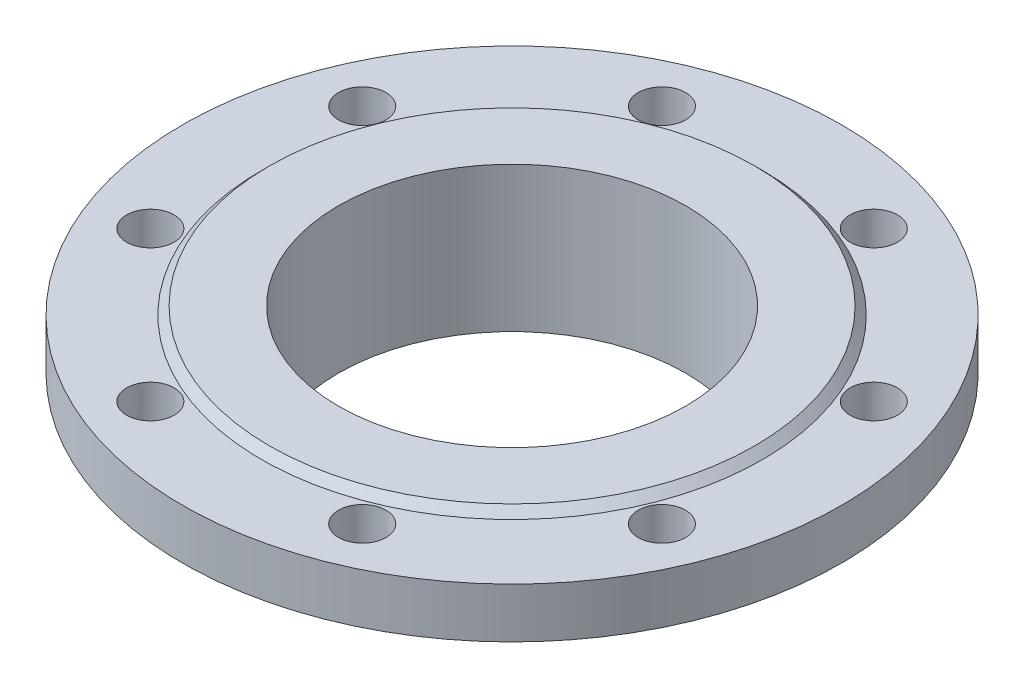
ISO-10303-21;
HEADER;
FILE_DESCRIPTION(('STEP AP214'),'2;1');
FILE_NAME('part.step','',(''),(''),'','','');
FILE_SCHEMA(('AUTOMOTIVE_DESIGN { 1 0 10303 214 1 1 1 1 }'));
ENDSEC;
DATA;
#1=APPLICATION_CONTEXT('core data for automotive mechanical design processes');
#2=APPLICATION_PROTOCOL_DEFINITION('international standard','automotive_design',2000,#1);
#3=PRODUCT_CONTEXT('',#1,'mechanical');
#4=PRODUCT('Part','Part','',(#3));
#5=PRODUCT_RELATED_PRODUCT_CATEGORY('part','',(#4));
#6=PRODUCT_DEFINITION_FORMATION('','',#4);
#7=PRODUCT_DEFINITION_CONTEXT('part definition',#1,'design');
#8=PRODUCT_DEFINITION('design','',#6,#7);
#9=PRODUCT_DEFINITION_SHAPE('','',#8);
#10=(LENGTH_UNIT() NAMED_UNIT(*) SI_UNIT(.MILLI.,.METRE.));
#11=(NAMED_UNIT(*) PLANE_ANGLE_UNIT() SI_UNIT($,.RADIAN.));
#12=(NAMED_UNIT(*) SI_UNIT($,.STERADIAN.) SOLID_ANGLE_UNIT());
#13=UNCERTAINTY_MEASURE_WITH_UNIT(LENGTH_MEASURE(1.E-05),#10,'distance_accuracy_value','');
#14=(GEOMETRIC_REPRESENTATION_CONTEXT(3) GLOBAL_UNCERTAINTY_ASSIGNED_CONTEXT((#13)) GLOBAL_UNIT_ASSIGNED_CONTEXT((#10,
#11,#12)) REPRESENTATION_CONTEXT('',''));
#15=CARTESIAN_POINT('',(0.,0.,0.));
#16=DIRECTION('',(0.,0.,1.));
#17=DIRECTION('',(1.,0.,0.));
#18=AXIS2_PLACEMENT_3D('',#15,#16,#17);
#19=CARTESIAN_POINT('',(-334.15,375.,0.));
#20=DIRECTION('',(0.,-1.,0.));
#21=DIRECTION('',(0.,0.,-1.));
#22=AXIS2_PLACEMENT_3D('',#19,#20,#21);
#23=PLANE('',#22);
#24=CARTESIAN_POINT('',(-400.,375.,0.));
#25=DIRECTION('',(0.,-1.,0.));
#26=DIRECTION('',(0.,0.,-1.));
#27=AXIS2_PLACEMENT_3D('',#24,#25,#26);
#28=CIRCLE('',#27,69.85);
#29=CARTESIAN_POINT('',(-400.,375.,-69.85));
#30=VERTEX_POINT('',#29);
#31=EDGE_CURVE('E10',#30,#30,#28,.T.);
#32=ORIENTED_EDGE('',*,*,#31,.T.);
#33=EDGE_LOOP('',(#32));
#34=FACE_BOUND('',#33,.T.);
#35=CARTESIAN_POINT('',(-400.,375.,0.));
#36=DIRECTION('',(0.,-1.,0.));
#37=DIRECTION('',(0.,0.,-1.));
#38=AXIS2_PLACEMENT_3D('',#35,#36,#37);
#39=CIRCLE('',#38,65.85);
#40=CARTESIAN_POINT('',(-400.,375.,-65.85));
#41=VERTEX_POINT('',#40);
#42=EDGE_CURVE('E60',#41,#41,#39,.T.);
#43=ORIENTED_EDGE('',*,*,#42,.F.);
#44=EDGE_LOOP('',(#43));
#45=FACE_BOUND('',#44,.T.);
#46=ADVANCED_FACE('F29',(#34,#45),#23,.T.);
#47=CARTESIAN_POINT('',(-400.,375.,0.));
#48=DIRECTION('',(0.,-1.,0.));
#49=DIRECTION('',(0.,0.,-1.));
#50=AXIS2_PLACEMENT_3D('',#47,#48,#49);
#51=CYLINDRICAL_SURFACE('',#50,69.85);
#52=CARTESIAN_POINT('',(-400.,387.,0.));
#53=DIRECTION('',(0.,-1.,0.));
#54=DIRECTION('',(0.,0.,-1.));
#55=AXIS2_PLACEMENT_3D('',#52,#53,#54);
#56=CIRCLE('',#55,69.85);
#57=CARTESIAN_POINT('',(-400.,387.,-69.85));
#58=VERTEX_POINT('',#57);
#59=EDGE_CURVE('E35',#58,#58,#56,.T.);
#60=ORIENTED_EDGE('',*,*,#59,.T.);
#61=EDGE_LOOP('',(#60));
#62=FACE_BOUND('',#61,.T.);
#63=ORIENTED_EDGE('',*,*,#31,.F.);
#64=EDGE_LOOP('',(#63));
#65=FACE_BOUND('',#64,.T.);
#66=ADVANCED_FACE('F153',(#62,#65),#51,.T.);
#67=CARTESIAN_POINT('',(-400.,387.,0.));
#68=DIRECTION('',(0.,1.,0.));
#69=DIRECTION('',(0.,0.,1.));
#70=AXIS2_PLACEMENT_3D('',#67,#68,#69);
#71=CONICAL_SURFACE('',#70,69.85,0.410910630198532);
#72=CARTESIAN_POINT('',(-400.,408.,0.));
#73=DIRECTION('',(0.,-1.,0.));
#74=DIRECTION('',(0.,0.,-1.));
#75=AXIS2_PLACEMENT_3D('',#72,#73,#74);
#76=CIRCLE('',#75,79.);
#77=CARTESIAN_POINT('',(-400.,408.,-79.));
#78=VERTEX_POINT('',#77);
#79=EDGE_CURVE('E39',#78,#78,#76,.T.);
#80=ORIENTED_EDGE('',*,*,#79,.T.);
#81=EDGE_LOOP('',(#80));
#82=FACE_BOUND('',#81,.T.);
#83=ORIENTED_EDGE('',*,*,#59,.F.);
#84=EDGE_LOOP('',(#83));
#85=FACE_BOUND('',#84,.T.);
#86=ADVANCED_FACE('F146',(#82,#85),#71,.T.);
#87=CARTESIAN_POINT('',(-321.,408.,0.));
#88=DIRECTION('',(0.,-1.,0.));
#89=DIRECTION('',(0.,0.,-1.));
#90=AXIS2_PLACEMENT_3D('',#87,#88,#89);
#91=PLANE('',#90);
#92=CARTESIAN_POINT('',(-359.818239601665,408.,-97.0073509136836));
#93=DIRECTION('',(0.,-1.,0.));
#94=DIRECTION('',(0.,0.,-1.));
#95=AXIS2_PLACEMENT_3D('',#92,#93,#94);
#96=CIRCLE('',#95,8.99999999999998);
#97=CARTESIAN_POINT('',(-359.818239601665,408.,-106.007350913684));
#98=VERTEX_POINT('',#97);
#99=EDGE_CURVE('E105',#98,#98,#96,.T.);
#100=ORIENTED_EDGE('',*,*,#99,.F.);
#101=EDGE_LOOP('',(#100));
#102=FACE_BOUND('',#101,.T.);
#103=CARTESIAN_POINT('',(-440.181760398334,408.,-97.007350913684));
#104=DIRECTION('',(0.,-1.,0.));
#105=DIRECTION('',(0.,0.,-1.));
#106=AXIS2_PLACEMENT_3D('',#103,#104,#105);
#107=CIRCLE('',#106,8.99999999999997);
#108=CARTESIAN_POINT('',(-440.181760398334,408.,-106.007350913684));
#109=VERTEX_POINT('',#108);
#110=EDGE_CURVE('E99',#109,#109,#107,.T.);
#111=ORIENTED_EDGE('',*,*,#110,.F.);
#112=EDGE_LOOP('',(#111));
#113=FACE_BOUND('',#112,.T.);
#114=CARTESIAN_POINT('',(-497.007350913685,408.,-40.1817603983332));
#115=DIRECTION('',(0.,-1.,0.));
#116=DIRECTION('',(0.,0.,-1.));
#117=AXIS2_PLACEMENT_3D('',#114,#115,#116);
#118=CIRCLE('',#117,8.99999999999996);
#119=CARTESIAN_POINT('',(-497.007350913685,408.,-49.1817603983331));
#120=VERTEX_POINT('',#119);
#121=EDGE_CURVE('E93',#120,#120,#118,.T.);
#122=ORIENTED_EDGE('',*,*,#121,.F.);
#123=EDGE_LOOP('',(#122));
#124=FACE_BOUND('',#123,.T.);
#125=CARTESIAN_POINT('',(-497.007350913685,408.,40.1817603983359));
#126=DIRECTION('',(0.,-1.,0.));
#127=DIRECTION('',(0.,0.,-1.));
#128=AXIS2_PLACEMENT_3D('',#125,#126,#127);
#129=CIRCLE('',#128,9.00000000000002);
#130=CARTESIAN_POINT('',(-497.007350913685,408.,31.1817603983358));
#131=VERTEX_POINT('',#130);
#132=EDGE_CURVE('E87',#131,#131,#129,.T.);
#133=ORIENTED_EDGE('',*,*,#132,.F.);
#134=EDGE_LOOP('',(#133));
#135=FACE_BOUND('',#134,.T.);
#136=CARTESIAN_POINT('',(-440.181760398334,408.,97.0073509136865));
#137=DIRECTION('',(0.,-1.,0.));
#138=DIRECTION('',(0.,0.,-1.));
#139=AXIS2_PLACEMENT_3D('',#136,#137,#138);
#140=CIRCLE('',#139,9.);
#141=CARTESIAN_POINT('',(-440.181760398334,408.,88.0073509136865));
#142=VERTEX_POINT('',#141);
#143=EDGE_CURVE('E81',#142,#142,#140,.T.);
#144=ORIENTED_EDGE('',*,*,#143,.F.);
#145=EDGE_LOOP('',(#144));
#146=FACE_BOUND('',#145,.T.);
#147=CARTESIAN_POINT('',(-359.818239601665,408.,97.0073509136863));
#148=DIRECTION('',(0.,-1.,0.));
#149=DIRECTION('',(0.,0.,-1.));
#150=AXIS2_PLACEMENT_3D('',#147,#148,#149);
#151=CIRCLE('',#150,8.99999999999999);
#152=CARTESIAN_POINT('',(-359.818239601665,408.,88.0073509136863));
#153=VERTEX_POINT('',#152);
#154=EDGE_CURVE('E75',#153,#153,#151,.T.);
#155=ORIENTED_EDGE('',*,*,#154,.F.);
#156=EDGE_LOOP('',(#155));
#157=FACE_BOUND('',#156,.T.);
#158=CARTESIAN_POINT('',(-302.992649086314,408.,40.1817603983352));
#159=DIRECTION('',(0.,-1.,0.));
#160=DIRECTION('',(0.,0.,-1.));
#161=AXIS2_PLACEMENT_3D('',#158,#159,#160);
#162=CIRCLE('',#161,9.);
#163=CARTESIAN_POINT('',(-302.992649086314,408.,31.1817603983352));
#164=VERTEX_POINT('',#163);
#165=EDGE_CURVE('E69',#164,#164,#162,.T.);
#166=ORIENTED_EDGE('',*,*,#165,.F.);
#167=EDGE_LOOP('',(#166));
#168=FACE_BOUND('',#167,.T.);
#169=CARTESIAN_POINT('',(-302.992649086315,408.,-40.1817603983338));
#170=DIRECTION('',(0.,-1.,0.));
#171=DIRECTION('',(0.,0.,-1.));
#172=AXIS2_PLACEMENT_3D('',#169,#170,#171);
#173=CIRCLE('',#172,8.99999999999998);
#174=CARTESIAN_POINT('',(-302.992649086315,408.,-49.1817603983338));
#175=VERTEX_POINT('',#174);
#176=EDGE_CURVE('E63',#175,#175,#173,.T.);
#177=ORIENTED_EDGE('',*,*,#176,.F.);
#178=EDGE_LOOP('',(#177));
#179=FACE_BOUND('',#178,.T.);
#180=CARTESIAN_POINT('',(-400.,408.,0.));
#181=DIRECTION('',(0.,-1.,0.));
#182=DIRECTION('',(0.,0.,-1.));
#183=AXIS2_PLACEMENT_3D('',#180,#181,#182);
#184=CIRCLE('',#183,125.);
#185=CARTESIAN_POINT('',(-400.,408.,-125.));
#186=VERTEX_POINT('',#185);
#187=EDGE_CURVE('E43',#186,#186,#184,.T.);
#188=ORIENTED_EDGE('',*,*,#187,.T.);
#189=EDGE_LOOP('',(#188));
#190=FACE_BOUND('',#189,.T.);
#191=ORIENTED_EDGE('',*,*,#79,.F.);
#192=EDGE_LOOP('',(#191));
#193=FACE_BOUND('',#192,.T.);
#194=ADVANCED_FACE('F140',(#102,#113,#124,#135,#146,#157,#168,#179,#190,#193),#91,.T.);
#195=CARTESIAN_POINT('',(-400.,375.,0.));
#196=DIRECTION('',(0.,-1.,0.));
#197=DIRECTION('',(0.,0.,-1.));
#198=AXIS2_PLACEMENT_3D('',#195,#196,#197);
#199=CYLINDRICAL_SURFACE('',#198,125.);
#200=CARTESIAN_POINT('',(-400.,427.,0.));
#201=DIRECTION('',(0.,-1.,0.));
#202=DIRECTION('',(0.,0.,-1.));
#203=AXIS2_PLACEMENT_3D('',#200,#201,#202);
#204=CIRCLE('',#203,125.);
#205=CARTESIAN_POINT('',(-400.,427.,-125.));
#206=VERTEX_POINT('',#205);
#207=EDGE_CURVE('E48',#206,#206,#204,.T.);
#208=ORIENTED_EDGE('',*,*,#207,.T.);
#209=EDGE_LOOP('',(#208));
#210=FACE_BOUND('',#209,.T.);
#211=ORIENTED_EDGE('',*,*,#187,.F.);
#212=EDGE_LOOP('',(#211));
#213=FACE_BOUND('',#212,.T.);
#214=ADVANCED_FACE('F118',(#210,#213),#199,.T.);
#215=CARTESIAN_POINT('',(-275.,427.,0.));
#216=DIRECTION('',(0.,1.,0.));
#217=DIRECTION('',(0.,0.,1.));
#218=AXIS2_PLACEMENT_3D('',#215,#216,#217);
#219=PLANE('',#218);
#220=CARTESIAN_POINT('',(-359.818239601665,427.,-97.0073509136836));
#221=DIRECTION('',(0.,1.,0.));
#222=DIRECTION('',(0.,0.,1.));
#223=AXIS2_PLACEMENT_3D('',#220,#221,#222);
#224=CIRCLE('',#223,8.99999999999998);
#225=CARTESIAN_POINT('',(-359.818239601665,427.,-88.0073509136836));
#226=VERTEX_POINT('',#225);
#227=EDGE_CURVE('E108',#226,#226,#224,.T.);
#228=ORIENTED_EDGE('',*,*,#227,.F.);
#229=EDGE_LOOP('',(#228));
#230=FACE_BOUND('',#229,.T.);
#231=CARTESIAN_POINT('',(-440.181760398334,427.,-97.007350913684));
#232=DIRECTION('',(0.,1.,0.));
#233=DIRECTION('',(0.,0.,1.));
#234=AXIS2_PLACEMENT_3D('',#231,#232,#233);
#235=CIRCLE('',#234,8.99999999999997);
#236=CARTESIAN_POINT('',(-440.181760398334,427.,-88.007350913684));
#237=VERTEX_POINT('',#236);
#238=EDGE_CURVE('E102',#237,#237,#235,.T.);
#239=ORIENTED_EDGE('',*,*,#238,.F.);
#240=EDGE_LOOP('',(#239));
#241=FACE_BOUND('',#240,.T.);
#242=CARTESIAN_POINT('',(-497.007350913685,427.,-40.1817603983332));
#243=DIRECTION('',(0.,1.,0.));
#244=DIRECTION('',(0.,0.,1.));
#245=AXIS2_PLACEMENT_3D('',#242,#243,#244);
#246=CIRCLE('',#245,8.99999999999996);
#247=CARTESIAN_POINT('',(-497.007350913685,427.,-31.1817603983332));
#248=VERTEX_POINT('',#247);
#249=EDGE_CURVE('E96',#248,#248,#246,.T.);
#250=ORIENTED_EDGE('',*,*,#249,.F.);
#251=EDGE_LOOP('',(#250));
#252=FACE_BOUND('',#251,.T.);
#253=CARTESIAN_POINT('',(-497.007350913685,427.,40.1817603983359));
#254=DIRECTION('',(0.,1.,0.));
#255=DIRECTION('',(0.,0.,1.));
#256=AXIS2_PLACEMENT_3D('',#253,#254,#255);
#257=CIRCLE('',#256,9.00000000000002);
#258=CARTESIAN_POINT('',(-497.007350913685,427.,49.1817603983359));
#259=VERTEX_POINT('',#258);
#260=EDGE_CURVE('E90',#259,#259,#257,.T.);
#261=ORIENTED_EDGE('',*,*,#260,.F.);
#262=EDGE_LOOP('',(#261));
#263=FACE_BOUND('',#262,.T.);
#264=CARTESIAN_POINT('',(-440.181760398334,427.,97.0073509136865));
#265=DIRECTION('',(0.,1.,0.));
#266=DIRECTION('',(0.,0.,1.));
#267=AXIS2_PLACEMENT_3D('',#264,#265,#266);
#268=CIRCLE('',#267,9.);
#269=CARTESIAN_POINT('',(-440.181760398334,427.,106.007350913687));
#270=VERTEX_POINT('',#269);
#271=EDGE_CURVE('E84',#270,#270,#268,.T.);
#272=ORIENTED_EDGE('',*,*,#271,.F.);
#273=EDGE_LOOP('',(#272));
#274=FACE_BOUND('',#273,.T.);
#275=CARTESIAN_POINT('',(-359.818239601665,427.,97.0073509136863));
#276=DIRECTION('',(0.,1.,0.));
#277=DIRECTION('',(0.,0.,1.));
#278=AXIS2_PLACEMENT_3D('',#275,#276,#277);
#279=CIRCLE('',#278,8.99999999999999);
#280=CARTESIAN_POINT('',(-359.818239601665,427.,106.007350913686));
#281=VERTEX_POINT('',#280);
#282=EDGE_CURVE('E78',#281,#281,#279,.T.);
#283=ORIENTED_EDGE('',*,*,#282,.F.);
#284=EDGE_LOOP('',(#283));
#285=FACE_BOUND('',#284,.T.);
#286=CARTESIAN_POINT('',(-302.992649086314,427.,40.1817603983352));
#287=DIRECTION('',(0.,1.,0.));
#288=DIRECTION('',(0.,0.,1.));
#289=AXIS2_PLACEMENT_3D('',#286,#287,#288);
#290=CIRCLE('',#289,9.);
#291=CARTESIAN_POINT('',(-302.992649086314,427.,49.1817603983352));
#292=VERTEX_POINT('',#291);
#293=EDGE_CURVE('E72',#292,#292,#290,.T.);
#294=ORIENTED_EDGE('',*,*,#293,.F.);
#295=EDGE_LOOP('',(#294));
#296=FACE_BOUND('',#295,.T.);
#297=CARTESIAN_POINT('',(-302.992649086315,427.,-40.1817603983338));
#298=DIRECTION('',(0.,1.,0.));
#299=DIRECTION('',(0.,0.,1.));
#300=AXIS2_PLACEMENT_3D('',#297,#298,#299);
#301=CIRCLE('',#300,8.99999999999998);
#302=CARTESIAN_POINT('',(-302.992649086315,427.,-31.1817603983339));
#303=VERTEX_POINT('',#302);
#304=EDGE_CURVE('E66',#303,#303,#301,.T.);
#305=ORIENTED_EDGE('',*,*,#304,.F.);
#306=EDGE_LOOP('',(#305));
#307=FACE_BOUND('',#306,.T.);
#308=CARTESIAN_POINT('',(-400.,427.,0.));
#309=DIRECTION('',(0.,-1.,0.));
#310=DIRECTION('',(0.,0.,-1.));
#311=AXIS2_PLACEMENT_3D('',#308,#309,#310);
#312=CIRCLE('',#311,94.9999999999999);
#313=CARTESIAN_POINT('',(-400.,427.,-94.9999999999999));
#314=VERTEX_POINT('',#313);
#315=EDGE_CURVE('E51',#314,#314,#312,.T.);
#316=ORIENTED_EDGE('',*,*,#315,.T.);
#317=EDGE_LOOP('',(#316));
#318=FACE_BOUND('',#317,.T.);
#319=ORIENTED_EDGE('',*,*,#207,.F.);
#320=EDGE_LOOP('',(#319));
#321=FACE_BOUND('',#320,.T.);
#322=ADVANCED_FACE('F114',(#230,#241,#252,#263,#274,#285,#296,#307,#318,#321),#219,.T.);
#323=CARTESIAN_POINT('',(-400.,427.,0.));
#324=DIRECTION('',(0.,-1.,0.));
#325=DIRECTION('',(0.,0.,-1.));
#326=AXIS2_PLACEMENT_3D('',#323,#324,#325);
#327=CONICAL_SURFACE('',#326,94.9999999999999,0.785398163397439);
#328=CARTESIAN_POINT('',(-400.,430.,0.));
#329=DIRECTION('',(0.,-1.,0.));
#330=DIRECTION('',(0.,0.,-1.));
#331=AXIS2_PLACEMENT_3D('',#328,#329,#330);
#332=CIRCLE('',#331,92.);
#333=CARTESIAN_POINT('',(-400.,430.,-92.));
#334=VERTEX_POINT('',#333);
#335=EDGE_CURVE('E54',#334,#334,#332,.T.);
#336=ORIENTED_EDGE('',*,*,#335,.T.);
#337=EDGE_LOOP('',(#336));
#338=FACE_BOUND('',#337,.T.);
#339=ORIENTED_EDGE('',*,*,#315,.F.);
#340=EDGE_LOOP('',(#339));
#341=FACE_BOUND('',#340,.T.);
#342=ADVANCED_FACE('F117',(#338,#341),#327,.T.);
#343=CARTESIAN_POINT('',(-308.,430.,0.));
#344=DIRECTION('',(0.,1.,0.));
#345=DIRECTION('',(0.,0.,1.));
#346=AXIS2_PLACEMENT_3D('',#343,#344,#345);
#347=PLANE('',#346);
#348=CARTESIAN_POINT('',(-400.,430.,0.));
#349=DIRECTION('',(0.,-1.,0.));
#350=DIRECTION('',(0.,0.,-1.));
#351=AXIS2_PLACEMENT_3D('',#348,#349,#350);
#352=CIRCLE('',#351,65.85);
#353=CARTESIAN_POINT('',(-400.,430.,-65.85));
#354=VERTEX_POINT('',#353);
#355=EDGE_CURVE('E57',#354,#354,#352,.T.);
#356=ORIENTED_EDGE('',*,*,#355,.T.);
#357=EDGE_LOOP('',(#356));
#358=FACE_BOUND('',#357,.T.);
#359=ORIENTED_EDGE('',*,*,#335,.F.);
#360=EDGE_LOOP('',(#359));
#361=FACE_BOUND('',#360,.T.);
#362=ADVANCED_FACE('F168',(#358,#361),#347,.T.);
#363=CARTESIAN_POINT('',(-400.,375.,0.));
#364=DIRECTION('',(0.,-1.,0.));
#365=DIRECTION('',(0.,0.,-1.));
#366=AXIS2_PLACEMENT_3D('',#363,#364,#365);
#367=CYLINDRICAL_SURFACE('',#366,65.85);
#368=ORIENTED_EDGE('',*,*,#42,.T.);
#369=EDGE_LOOP('',(#368));
#370=FACE_BOUND('',#369,.T.);
#371=ORIENTED_EDGE('',*,*,#355,.F.);
#372=EDGE_LOOP('',(#371));
#373=FACE_BOUND('',#372,.T.);
#374=ADVANCED_FACE('F164',(#370,#373),#367,.F.);
#375=CARTESIAN_POINT('',(-302.992649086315,375.,-40.1817603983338));
#376=DIRECTION('',(0.,1.,0.));
#377=DIRECTION('',(0.,0.,1.));
#378=AXIS2_PLACEMENT_3D('',#375,#376,#377);
#379=CYLINDRICAL_SURFACE('',#378,8.99999999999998);
#380=ORIENTED_EDGE('',*,*,#176,.T.);
#381=EDGE_LOOP('',(#380));
#382=FACE_BOUND('',#381,.T.);
#383=ORIENTED_EDGE('',*,*,#304,.T.);
#384=EDGE_LOOP('',(#383));
#385=FACE_BOUND('',#384,.T.);
#386=ADVANCED_FACE('F167',(#382,#385),#379,.F.);
#387=CARTESIAN_POINT('',(-302.992649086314,375.,40.1817603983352));
#388=DIRECTION('',(0.,1.,0.));
#389=DIRECTION('',(0.,0.,1.));
#390=AXIS2_PLACEMENT_3D('',#387,#388,#389);
#391=CYLINDRICAL_SURFACE('',#390,9.);
#392=ORIENTED_EDGE('',*,*,#165,.T.);
#393=EDGE_LOOP('',(#392));
#394=FACE_BOUND('',#393,.T.);
#395=ORIENTED_EDGE('',*,*,#293,.T.);
#396=EDGE_LOOP('',(#395));
#397=FACE_BOUND('',#396,.T.);
#398=ADVANCED_FACE('F185',(#394,#397),#391,.F.);
#399=CARTESIAN_POINT('',(-359.818239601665,375.,97.0073509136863));
#400=DIRECTION('',(0.,1.,0.));
#401=DIRECTION('',(0.,0.,1.));
#402=AXIS2_PLACEMENT_3D('',#399,#400,#401);
#403=CYLINDRICAL_SURFACE('',#402,8.99999999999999);
#404=ORIENTED_EDGE('',*,*,#154,.T.);
#405=EDGE_LOOP('',(#404));
#406=FACE_BOUND('',#405,.T.);
#407=ORIENTED_EDGE('',*,*,#282,.T.);
#408=EDGE_LOOP('',(#407));
#409=FACE_BOUND('',#408,.T.);
#410=ADVANCED_FACE('F189',(#406,#409),#403,.F.);
#411=CARTESIAN_POINT('',(-440.181760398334,375.,97.0073509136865));
#412=DIRECTION('',(0.,1.,0.));
#413=DIRECTION('',(0.,0.,1.));
#414=AXIS2_PLACEMENT_3D('',#411,#412,#413);
#415=CYLINDRICAL_SURFACE('',#414,9.);
#416=ORIENTED_EDGE('',*,*,#143,.T.);
#417=EDGE_LOOP('',(#416));
#418=FACE_BOUND('',#417,.T.);
#419=ORIENTED_EDGE('',*,*,#271,.T.);
#420=EDGE_LOOP('',(#419));
#421=FACE_BOUND('',#420,.T.);
#422=ADVANCED_FACE('F193',(#418,#421),#415,.F.);
#423=CARTESIAN_POINT('',(-497.007350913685,375.,40.1817603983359));
#424=DIRECTION('',(0.,1.,0.));
#425=DIRECTION('',(0.,0.,1.));
#426=AXIS2_PLACEMENT_3D('',#423,#424,#425);
#427=CYLINDRICAL_SURFACE('',#426,9.00000000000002);
#428=ORIENTED_EDGE('',*,*,#132,.T.);
#429=EDGE_LOOP('',(#428));
#430=FACE_BOUND('',#429,.T.);
#431=ORIENTED_EDGE('',*,*,#260,.T.);
#432=EDGE_LOOP('',(#431));
#433=FACE_BOUND('',#432,.T.);
#434=ADVANCED_FACE('F197',(#430,#433),#427,.F.);
#435=CARTESIAN_POINT('',(-497.007350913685,375.,-40.1817603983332));
#436=DIRECTION('',(0.,1.,0.));
#437=DIRECTION('',(0.,0.,1.));
#438=AXIS2_PLACEMENT_3D('',#435,#436,#437);
#439=CYLINDRICAL_SURFACE('',#438,8.99999999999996);
#440=ORIENTED_EDGE('',*,*,#121,.T.);
#441=EDGE_LOOP('',(#440));
#442=FACE_BOUND('',#441,.T.);
#443=ORIENTED_EDGE('',*,*,#249,.T.);
#444=EDGE_LOOP('',(#443));
#445=FACE_BOUND('',#444,.T.);
#446=ADVANCED_FACE('F201',(#442,#445),#439,.F.);
#447=CARTESIAN_POINT('',(-440.181760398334,375.,-97.007350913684));
#448=DIRECTION('',(0.,1.,0.));
#449=DIRECTION('',(0.,0.,1.));
#450=AXIS2_PLACEMENT_3D('',#447,#448,#449);
#451=CYLINDRICAL_SURFACE('',#450,8.99999999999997);
#452=ORIENTED_EDGE('',*,*,#110,.T.);
#453=EDGE_LOOP('',(#452));
#454=FACE_BOUND('',#453,.T.);
#455=ORIENTED_EDGE('',*,*,#238,.T.);
#456=EDGE_LOOP('',(#455));
#457=FACE_BOUND('',#456,.T.);
#458=ADVANCED_FACE('F205',(#454,#457),#451,.F.);
#459=CARTESIAN_POINT('',(-359.818239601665,375.,-97.0073509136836));
#460=DIRECTION('',(0.,1.,0.));
#461=DIRECTION('',(0.,0.,1.));
#462=AXIS2_PLACEMENT_3D('',#459,#460,#461);
#463=CYLINDRICAL_SURFACE('',#462,8.99999999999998);
#464=ORIENTED_EDGE('',*,*,#99,.T.);
#465=EDGE_LOOP('',(#464));
#466=FACE_BOUND('',#465,.T.);
#467=ORIENTED_EDGE('',*,*,#227,.T.);
#468=EDGE_LOOP('',(#467));
#469=FACE_BOUND('',#468,.T.);
#470=ADVANCED_FACE('F112',(#466,#469),#463,.F.);
#471=CLOSED_SHELL('',(#46,#66,#86,#194,#214,#322,#342,#362,#374,#386,#398,#410,#422,#434,#446,
#458,#470));
#472=MANIFOLD_SOLID_BREP('B2',#471);
#473=ADVANCED_BREP_SHAPE_REPRESENTATION('',(#18,#472),#14);
#474=SHAPE_DEFINITION_REPRESENTATION(#9,#473);
ENDSEC;
END-ISO-10303-21;
